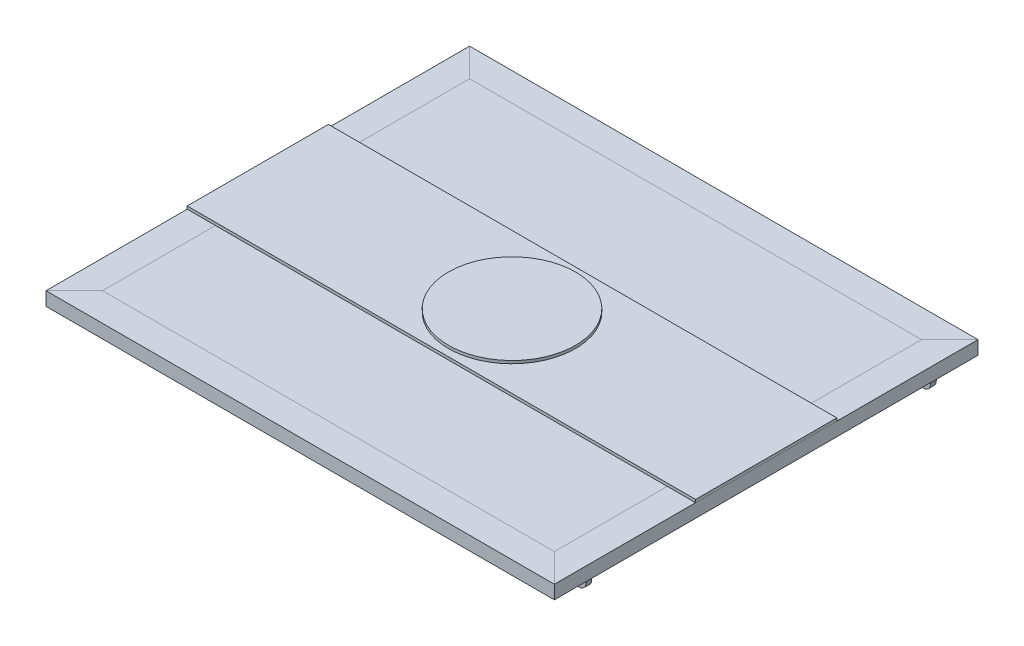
from build123d import *

# Parameters (mm, degrees)
MEMBER_10_1_DEPTH      = 1411.923396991
MEMBER_10_1_DEPTH_BACK = 111.923396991
MEMBER_10_1_2_DEPTH    = 1823.846793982
MEMBER_10_1_3_DEPTH    = 1523.846793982
MEMBER_10_1_4_DEPTH    = 1823.846793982
MEMBER_10_1_5_DEPTH    = 1302
MEMBER_10_1_6_DEPTH    = 1302
SKETCH_4_W             = 64.398136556
SKETCH_4_H             = 20
EXTRUDE_1_DEPTH        = 90
SKETCH_5_R             = 10
CUT_EXTRUDE_1_DEPTH    = 1642.944606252
FILLET_1_R             = 25
SKETCH_6_W             = 1800
SKETCH_6_H             = 500
EXTRUDE_2_DEPTH        = 10
SKETCH_7_R             = 225
EXTRUDE_3_DEPTH        = 10
SKETCH_9_W             = 1600
SKETCH_9_H             = 1300
EXTRUDE_5_DEPTH        = 48


with BuildPart() as part:
    # Sketch11 → Member 10_1 (new, two sides: drawn at the far end of the back side and taken through both)
    with BuildSketch(Plane(origin=(-800, 0, 650), x_dir=(0, 1, 0), z_dir=(0, 0, -1)).offset(-MEMBER_10_1_DEPTH_BACK)):
        with BuildLine():
            Line((0, 0), (0, -100))
            Line((0, -100), (-48, -100))
            Line((-48, -100), (-48, -97.265512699))
            ThreePointArc((-48, -97.265512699), (-46.867155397, -94.376595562), (-44.072544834, -93.027769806))
            Line((-44.072544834, -93.027769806), (-13.154910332, -90.674554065))
            ThreePointArc((-13.154910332, -90.674554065), (-7.565689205, -87.976902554), (-5.3, -82.199068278))
            Line((-5.3, -82.199068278), (-5.3, -17.800931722))
            ThreePointArc((-5.3, -17.800931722), (-7.565689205, -12.023097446), (-13.154910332, -9.325445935))
            Line((-13.154910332, -9.325445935), (-44.072544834, -6.972230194))
            ThreePointArc((-44.072544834, -6.972230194), (-46.867155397, -5.623404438), (-48, -2.734487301))
            Line((-48, -2.734487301), (-48, 0))
            Line((-48, 0), (0, 0))
        make_face()
    extrude(amount=MEMBER_10_1_DEPTH + MEMBER_10_1_DEPTH_BACK)

    # Member 10_1 mitre 1
    split(bisect_by=Plane(origin=(-800, 0, 650), x_dir=(0, -1, 0), z_dir=(-0.707106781, 0, -0.707106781)), keep=Keep.TOP)

    # Member 10_1 mitre 2
    split(bisect_by=Plane(origin=(-800, 0, -650), x_dir=(0, -1, 0), z_dir=(-0.707106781, 0, 0.707106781)), keep=Keep.TOP)


with BuildPart() as body_2:
    # Sketch11 on segment 2 (on carried to segment 2) → Member 10_1 2 (new body)
    with BuildSketch(Plane(origin=(-911.923396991, 0, -650), x_dir=(0, 1, 0), z_dir=(1, 0, 0))):
        with BuildLine():
            Line((0, 0), (0, -100))
            Line((0, -100), (-48, -100))
            Line((-48, -100), (-48, -97.265512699))
            ThreePointArc((-48, -97.265512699), (-46.867155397, -94.376595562), (-44.072544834, -93.027769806))
            Line((-44.072544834, -93.027769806), (-13.154910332, -90.674554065))
            ThreePointArc((-13.154910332, -90.674554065), (-7.565689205, -87.976902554), (-5.3, -82.199068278))
            Line((-5.3, -82.199068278), (-5.3, -17.800931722))
            ThreePointArc((-5.3, -17.800931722), (-7.565689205, -12.023097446), (-13.154910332, -9.325445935))
            Line((-13.154910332, -9.325445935), (-44.072544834, -6.972230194))
            ThreePointArc((-44.072544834, -6.972230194), (-46.867155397, -5.623404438), (-48, -2.734487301))
            Line((-48, -2.734487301), (-48, 0))
            Line((-48, 0), (0, 0))
        make_face()
    extrude(amount=MEMBER_10_1_2_DEPTH)

    # Member 10_1 2 mitre 1
    split(bisect_by=Plane(origin=(-800, 0, -650), x_dir=(0, 1, 0), z_dir=(0.707106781, 0, -0.707106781)), keep=Keep.TOP)

    # Member 10_1 2 mitre 2
    split(bisect_by=Plane(origin=(800, 0, -650), x_dir=(0, -1, 0), z_dir=(-0.707106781, 0, -0.707106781)), keep=Keep.TOP)


with BuildPart() as body_3:
    # Sketch11 on segment 3 (on carried to segment 3) → Member 10_1 3 (new body)
    with BuildSketch(Plane(origin=(800, 0, -761.923396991), x_dir=(0, 1, 0), z_dir=(0, 0, 1))):
        with BuildLine():
            Line((0, 0), (0, -100))
            Line((0, -100), (-48, -100))
            Line((-48, -100), (-48, -97.265512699))
            ThreePointArc((-48, -97.265512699), (-46.867155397, -94.376595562), (-44.072544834, -93.027769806))
            Line((-44.072544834, -93.027769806), (-13.154910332, -90.674554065))
            ThreePointArc((-13.154910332, -90.674554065), (-7.565689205, -87.976902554), (-5.3, -82.199068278))
            Line((-5.3, -82.199068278), (-5.3, -17.800931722))
            ThreePointArc((-5.3, -17.800931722), (-7.565689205, -12.023097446), (-13.154910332, -9.325445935))
            Line((-13.154910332, -9.325445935), (-44.072544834, -6.972230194))
            ThreePointArc((-44.072544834, -6.972230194), (-46.867155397, -5.623404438), (-48, -2.734487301))
            Line((-48, -2.734487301), (-48, 0))
            Line((-48, 0), (0, 0))
        make_face()
    extrude(amount=MEMBER_10_1_3_DEPTH)

    # Member 10_1 3 mitre 1
    split(bisect_by=Plane(origin=(800, 0, 650), x_dir=(0, 1, 0), z_dir=(0.707106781, 0, -0.707106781)), keep=Keep.TOP)

    # Member 10_1 3 mitre 2
    split(bisect_by=Plane(origin=(800, 0, -650), x_dir=(0, 1, 0), z_dir=(0.707106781, 0, 0.707106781)), keep=Keep.TOP)

    # Sketch 4 → Extrude 1 (add)
    with BuildSketch(Plane.XZ.offset(5.3)):
        with Locations((850, -610)):
            Rectangle(SKETCH_4_W, SKETCH_4_H)
        with Locations((850, 610)):
            Rectangle(SKETCH_4_W, SKETCH_4_H)
    extrude(amount=EXTRUDE_1_DEPTH)

    # Sketch 5 → Cut-Extrude 1 (cut, through all)
    with BuildSketch(Plane(origin=(0, 0, -620), x_dir=(-1, 0, 0), z_dir=(0, 0, -1))):
        with Locations((-850, -75.3)):
            Circle(SKETCH_5_R)
    extrude(amount=-CUT_EXTRUDE_1_DEPTH, mode=Mode.SUBTRACT)

    # Fillet 1
    fillet_1_edges = [body_3.edges().sort_by_distance(p)[0] for p in [
        (817.800931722, -95.3, -610),
        (882.199068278, -95.3, -610),
        (882.199068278, -95.3, 610),
        (817.800931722, -95.3, 610),
    ]]
    fillet(fillet_1_edges, radius=FILLET_1_R)


with BuildPart() as body_4:
    # Sketch11 on segment 4 (on carried to segment 4) → Member 10_1 4 (new body)
    with BuildSketch(Plane(origin=(911.923396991, 0, 650), x_dir=(0, 1, 0), z_dir=(-1, 0, 0))):
        with BuildLine():
            Line((0, 0), (0, -100))
            Line((0, -100), (-48, -100))
            Line((-48, -100), (-48, -97.265512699))
            ThreePointArc((-48, -97.265512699), (-46.867155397, -94.376595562), (-44.072544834, -93.027769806))
            Line((-44.072544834, -93.027769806), (-13.154910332, -90.674554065))
            ThreePointArc((-13.154910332, -90.674554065), (-7.565689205, -87.976902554), (-5.3, -82.199068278))
            Line((-5.3, -82.199068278), (-5.3, -17.800931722))
            ThreePointArc((-5.3, -17.800931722), (-7.565689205, -12.023097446), (-13.154910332, -9.325445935))
            Line((-13.154910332, -9.325445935), (-44.072544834, -6.972230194))
            ThreePointArc((-44.072544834, -6.972230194), (-46.867155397, -5.623404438), (-48, -2.734487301))
            Line((-48, -2.734487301), (-48, 0))
            Line((-48, 0), (0, 0))
        make_face()
    extrude(amount=MEMBER_10_1_4_DEPTH)

    # Member 10_1 4 mitre 1
    split(bisect_by=Plane(origin=(-800, 0, 650), x_dir=(0, 1, 0), z_dir=(0.707106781, 0, 0.707106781)), keep=Keep.TOP)

    # Member 10_1 4 mitre 2
    split(bisect_by=Plane(origin=(800, 0, 650), x_dir=(0, -1, 0), z_dir=(-0.707106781, 0, 0.707106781)), keep=Keep.TOP)


with BuildPart() as body_5:
    # Sketch11 on segment 5 (on carried to segment 5) → Member 10_1 5 (new body)
    with BuildSketch(Plane(origin=(-200, 0, -651), x_dir=(0, 1, 0), z_dir=(0, 0, 1))):
        with BuildLine():
            Line((0, 0), (0, -100))
            Line((0, -100), (-48, -100))
            Line((-48, -100), (-48, -97.265512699))
            ThreePointArc((-48, -97.265512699), (-46.867155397, -94.376595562), (-44.072544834, -93.027769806))
            Line((-44.072544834, -93.027769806), (-13.154910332, -90.674554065))
            ThreePointArc((-13.154910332, -90.674554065), (-7.565689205, -87.976902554), (-5.3, -82.199068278))
            Line((-5.3, -82.199068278), (-5.3, -17.800931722))
            ThreePointArc((-5.3, -17.800931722), (-7.565689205, -12.023097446), (-13.154910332, -9.325445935))
            Line((-13.154910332, -9.325445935), (-44.072544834, -6.972230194))
            ThreePointArc((-44.072544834, -6.972230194), (-46.867155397, -5.623404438), (-48, -2.734487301))
            Line((-48, -2.734487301), (-48, 0))
            Line((-48, 0), (0, 0))
        make_face()
    extrude(amount=MEMBER_10_1_5_DEPTH)

    # Member 10_1 5 mitre 1
    split(bisect_by=Plane(origin=(-200, 0, -650), x_dir=(0, -1, 0), z_dir=(0, 0, 1)), keep=Keep.TOP)

    # Member 10_1 5 mitre 2
    split(bisect_by=Plane(origin=(-200, 0, 650), x_dir=(0, 1, 0), z_dir=(0, 0, -1)), keep=Keep.TOP)


with BuildPart() as body_6:
    # Sketch11 on segment 6 (on carried to segment 6) → Member 10_1 6 (new body)
    with BuildSketch(Plane(origin=(200, 0, -651), x_dir=(0, 1, 0), z_dir=(0, 0, 1))):
        with BuildLine():
            Line((0, 0), (0, -100))
            Line((0, -100), (-48, -100))
            Line((-48, -100), (-48, -97.265512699))
            ThreePointArc((-48, -97.265512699), (-46.867155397, -94.376595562), (-44.072544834, -93.027769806))
            Line((-44.072544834, -93.027769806), (-13.154910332, -90.674554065))
            ThreePointArc((-13.154910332, -90.674554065), (-7.565689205, -87.976902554), (-5.3, -82.199068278))
            Line((-5.3, -82.199068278), (-5.3, -17.800931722))
            ThreePointArc((-5.3, -17.800931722), (-7.565689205, -12.023097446), (-13.154910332, -9.325445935))
            Line((-13.154910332, -9.325445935), (-44.072544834, -6.972230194))
            ThreePointArc((-44.072544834, -6.972230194), (-46.867155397, -5.623404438), (-48, -2.734487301))
            Line((-48, -2.734487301), (-48, 0))
            Line((-48, 0), (0, 0))
        make_face()
    extrude(amount=MEMBER_10_1_6_DEPTH)

    # Member 10_1 6 mitre 1
    split(bisect_by=Plane(origin=(200, 0, -650), x_dir=(0, -1, 0), z_dir=(0, 0, 1)), keep=Keep.TOP)

    # Member 10_1 6 mitre 2
    split(bisect_by=Plane(origin=(200, 0, 650), x_dir=(0, 1, 0), z_dir=(0, 0, -1)), keep=Keep.TOP)


with BuildPart() as body_7:
    # Sketch 6 → Extrude 2 (new body)
    with BuildSketch(Plane(origin=(0, 0, 0), x_dir=(1, 0, 0), z_dir=(0, 1, 0))):
        Rectangle(SKETCH_6_W, SKETCH_6_H)
    extrude(amount=EXTRUDE_2_DEPTH)


with BuildPart() as body_8:
    # Sketch 7 → Extrude 3 (new body)
    with BuildSketch(Plane(origin=(0, 10, 0), x_dir=(1, 0, 0), z_dir=(0, 1, 0))):
        with Locations(Location((0, 0, 0), (0, 0, 180))):
            Circle(SKETCH_7_R)
    extrude(amount=EXTRUDE_3_DEPTH)


with BuildPart() as body_9:
    # Sketch 9 → Extrude 5 (new body)
    with BuildSketch(Plane(origin=(0, 0, 0), x_dir=(-1, 0, 0), z_dir=(0, -1, 0))):
        Rectangle(SKETCH_9_W, SKETCH_9_H)
    extrude(amount=EXTRUDE_5_DEPTH)


solid = Compound([part.part, body_2.part, body_3.part, body_4.part, body_5.part, body_6.part, body_7.part, body_8.part, body_9.part])
